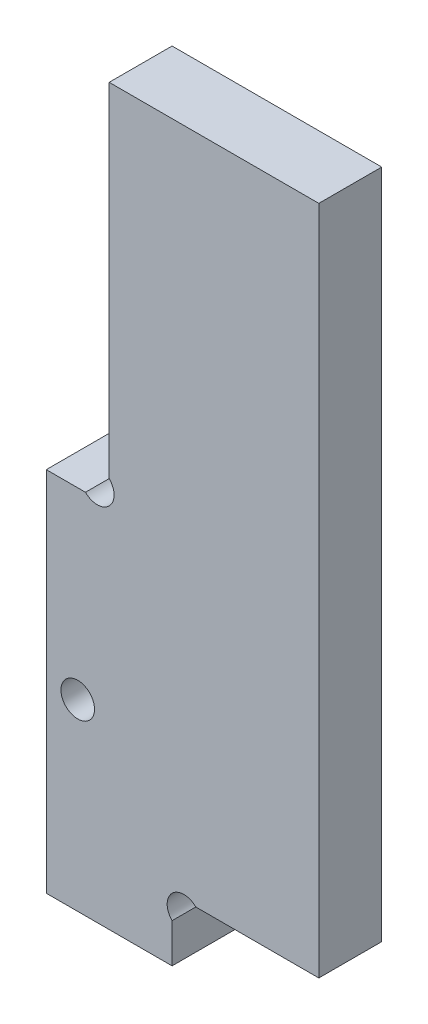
from build123d import *

# Parameters (mm, degrees)
ESQUISSE1_R        = 1.6
BOSS_EXTRU_1_DEPTH = 6


with BuildPart() as part:
    # Esquisse1 → Boss.-Extru.1 (new body)
    with BuildSketch(Plane.XY):
        with BuildLine():
            Line((12, 3.7372583), (12, 0))
            Line((12, 0), (0, 0))
            Line((0, 0), (0, 35))
            Line((0, 35), (3.7372583, 35))
            ThreePointArc((3.7372583, 35), (6, 35), (6, 37.2627417))
            Line((6, 37.2627417), (6, 70))
            Line((6, 70), (26, 70))
            Line((26, 70), (26, 6))
            Line((26, 6), (14.2627417, 6))
            ThreePointArc((14.2627417, 6), (12, 6), (12, 3.7372583))
        make_face()
        with Locations((3, 17.5)):
            Circle(ESQUISSE1_R, mode=Mode.SUBTRACT)
    extrude(amount=BOSS_EXTRU_1_DEPTH)


solid = part.part
